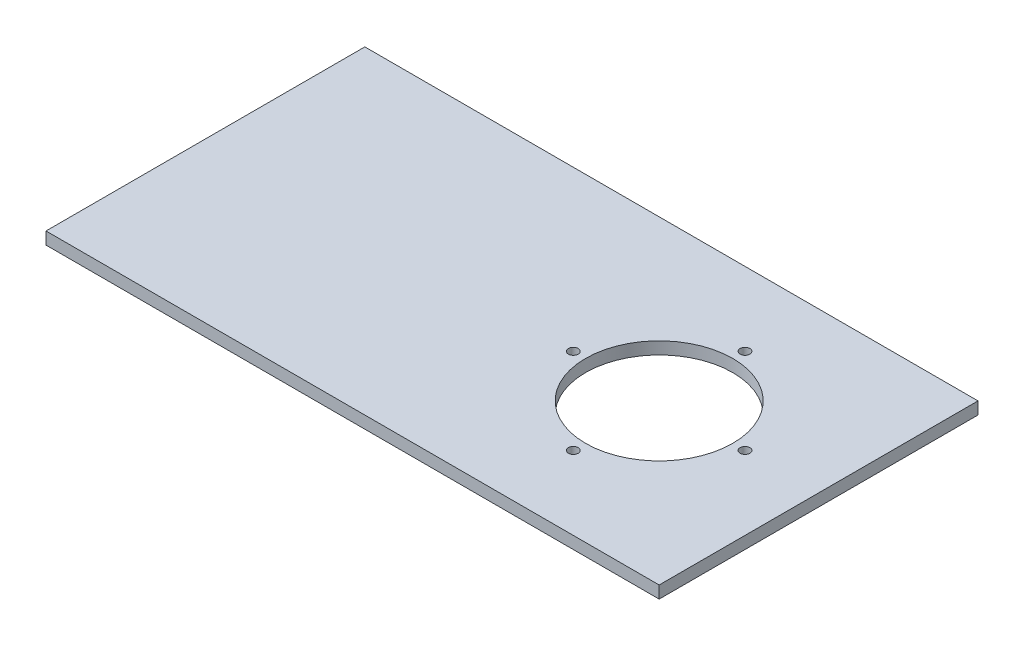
ISO-10303-21;
HEADER;
FILE_DESCRIPTION(('STEP AP214'),'2;1');
FILE_NAME('part.step','',(''),(''),'','','');
FILE_SCHEMA(('AUTOMOTIVE_DESIGN { 1 0 10303 214 1 1 1 1 }'));
ENDSEC;
DATA;
#1=APPLICATION_CONTEXT('core data for automotive mechanical design processes');
#2=APPLICATION_PROTOCOL_DEFINITION('international standard','automotive_design',2000,#1);
#3=PRODUCT_CONTEXT('',#1,'mechanical');
#4=PRODUCT('Part','Part','',(#3));
#5=PRODUCT_RELATED_PRODUCT_CATEGORY('part','',(#4));
#6=PRODUCT_DEFINITION_FORMATION('','',#4);
#7=PRODUCT_DEFINITION_CONTEXT('part definition',#1,'design');
#8=PRODUCT_DEFINITION('design','',#6,#7);
#9=PRODUCT_DEFINITION_SHAPE('','',#8);
#10=(LENGTH_UNIT() NAMED_UNIT(*) SI_UNIT(.MILLI.,.METRE.));
#11=(NAMED_UNIT(*) PLANE_ANGLE_UNIT() SI_UNIT($,.RADIAN.));
#12=(NAMED_UNIT(*) SI_UNIT($,.STERADIAN.) SOLID_ANGLE_UNIT());
#13=UNCERTAINTY_MEASURE_WITH_UNIT(LENGTH_MEASURE(1.E-05),#10,'distance_accuracy_value','');
#14=(GEOMETRIC_REPRESENTATION_CONTEXT(3) GLOBAL_UNCERTAINTY_ASSIGNED_CONTEXT((#13)) GLOBAL_UNIT_ASSIGNED_CONTEXT((#10,
#11,#12)) REPRESENTATION_CONTEXT('',''));
#15=CARTESIAN_POINT('',(0.,0.,0.));
#16=DIRECTION('',(0.,0.,1.));
#17=DIRECTION('',(1.,0.,0.));
#18=AXIS2_PLACEMENT_3D('',#15,#16,#17);
#19=CARTESIAN_POINT('',(0.,6.35,0.));
#20=DIRECTION('',(1.,0.,0.));
#21=DIRECTION('',(0.,0.,-1.));
#22=AXIS2_PLACEMENT_3D('',#19,#20,#21);
#23=PLANE('',#22);
#24=DIRECTION('',(0.,0.,1.));
#25=VECTOR('',#24,1.);
#26=CARTESIAN_POINT('',(0.,0.,0.));
#27=LINE('',#26,#25);
#28=CARTESIAN_POINT('',(0.,0.,-165.1));
#29=VERTEX_POINT('',#28);
#30=CARTESIAN_POINT('',(0.,0.,0.));
#31=VERTEX_POINT('',#30);
#32=EDGE_CURVE('E113',#29,#31,#27,.T.);
#33=ORIENTED_EDGE('',*,*,#32,.T.);
#34=DIRECTION('',(0.,-1.,0.));
#35=VECTOR('',#34,1.);
#36=CARTESIAN_POINT('',(0.,6.35,0.));
#37=LINE('',#36,#35);
#38=CARTESIAN_POINT('',(0.,6.35,0.));
#39=VERTEX_POINT('',#38);
#40=EDGE_CURVE('E11',#39,#31,#37,.T.);
#41=ORIENTED_EDGE('',*,*,#40,.F.);
#42=DIRECTION('',(0.,0.,1.));
#43=VECTOR('',#42,1.);
#44=CARTESIAN_POINT('',(0.,6.35,0.));
#45=LINE('',#44,#43);
#46=CARTESIAN_POINT('',(0.,6.35,-165.1));
#47=VERTEX_POINT('',#46);
#48=EDGE_CURVE('E97',#47,#39,#45,.T.);
#49=ORIENTED_EDGE('',*,*,#48,.F.);
#50=DIRECTION('',(0.,-1.,0.));
#51=VECTOR('',#50,1.);
#52=CARTESIAN_POINT('',(0.,6.35,-165.1));
#53=LINE('',#52,#51);
#54=EDGE_CURVE('E109',#47,#29,#53,.T.);
#55=ORIENTED_EDGE('',*,*,#54,.T.);
#56=EDGE_LOOP('',(#33,#41,#49,#55));
#57=FACE_BOUND('',#56,.T.);
#58=ADVANCED_FACE('F45',(#57),#23,.F.);
#59=CARTESIAN_POINT('',(0.,6.35,0.));
#60=DIRECTION('',(0.,0.,-1.));
#61=DIRECTION('',(-1.,0.,0.));
#62=AXIS2_PLACEMENT_3D('',#59,#60,#61);
#63=PLANE('',#62);
#64=DIRECTION('',(1.,0.,0.));
#65=VECTOR('',#64,1.);
#66=CARTESIAN_POINT('',(0.,0.,0.));
#67=LINE('',#66,#65);
#68=CARTESIAN_POINT('',(317.5,0.,0.));
#69=VERTEX_POINT('',#68);
#70=EDGE_CURVE('E102',#31,#69,#67,.T.);
#71=ORIENTED_EDGE('',*,*,#70,.T.);
#72=DIRECTION('',(0.,-1.,0.));
#73=VECTOR('',#72,1.);
#74=CARTESIAN_POINT('',(317.5,6.35,0.));
#75=LINE('',#74,#73);
#76=CARTESIAN_POINT('',(317.5,6.35,0.));
#77=VERTEX_POINT('',#76);
#78=EDGE_CURVE('E54',#77,#69,#75,.T.);
#79=ORIENTED_EDGE('',*,*,#78,.F.);
#80=DIRECTION('',(1.,0.,0.));
#81=VECTOR('',#80,1.);
#82=CARTESIAN_POINT('',(0.,6.35,0.));
#83=LINE('',#82,#81);
#84=EDGE_CURVE('E92',#39,#77,#83,.T.);
#85=ORIENTED_EDGE('',*,*,#84,.F.);
#86=ORIENTED_EDGE('',*,*,#40,.T.);
#87=EDGE_LOOP('',(#71,#79,#85,#86));
#88=FACE_BOUND('',#87,.T.);
#89=ADVANCED_FACE('F101',(#88),#63,.F.);
#90=CARTESIAN_POINT('',(317.5,6.35,0.));
#91=DIRECTION('',(-1.,0.,0.));
#92=DIRECTION('',(0.,0.,1.));
#93=AXIS2_PLACEMENT_3D('',#90,#91,#92);
#94=PLANE('',#93);
#95=DIRECTION('',(0.,0.,-1.));
#96=VECTOR('',#95,1.);
#97=CARTESIAN_POINT('',(317.5,0.,0.));
#98=LINE('',#97,#96);
#99=CARTESIAN_POINT('',(317.5,0.,-165.1));
#100=VERTEX_POINT('',#99);
#101=EDGE_CURVE('E79',#69,#100,#98,.T.);
#102=ORIENTED_EDGE('',*,*,#101,.T.);
#103=DIRECTION('',(0.,-1.,0.));
#104=VECTOR('',#103,1.);
#105=CARTESIAN_POINT('',(317.5,6.35,-165.1));
#106=LINE('',#105,#104);
#107=CARTESIAN_POINT('',(317.5,6.35,-165.1));
#108=VERTEX_POINT('',#107);
#109=EDGE_CURVE('E104',#108,#100,#106,.T.);
#110=ORIENTED_EDGE('',*,*,#109,.F.);
#111=DIRECTION('',(0.,0.,-1.));
#112=VECTOR('',#111,1.);
#113=CARTESIAN_POINT('',(317.5,6.35,0.));
#114=LINE('',#113,#112);
#115=EDGE_CURVE('E95',#77,#108,#114,.T.);
#116=ORIENTED_EDGE('',*,*,#115,.F.);
#117=ORIENTED_EDGE('',*,*,#78,.T.);
#118=EDGE_LOOP('',(#102,#110,#116,#117));
#119=FACE_BOUND('',#118,.T.);
#120=ADVANCED_FACE('F105',(#119),#94,.F.);
#121=CARTESIAN_POINT('',(0.,6.35,-165.1));
#122=DIRECTION('',(0.,0.,1.));
#123=DIRECTION('',(1.,0.,0.));
#124=AXIS2_PLACEMENT_3D('',#121,#122,#123);
#125=PLANE('',#124);
#126=DIRECTION('',(-1.,0.,0.));
#127=VECTOR('',#126,1.);
#128=CARTESIAN_POINT('',(0.,0.,-165.1));
#129=LINE('',#128,#127);
#130=EDGE_CURVE('E85',#100,#29,#129,.T.);
#131=ORIENTED_EDGE('',*,*,#130,.T.);
#132=ORIENTED_EDGE('',*,*,#54,.F.);
#133=DIRECTION('',(-1.,0.,0.));
#134=VECTOR('',#133,1.);
#135=CARTESIAN_POINT('',(0.,6.35,-165.1));
#136=LINE('',#135,#134);
#137=EDGE_CURVE('E62',#108,#47,#136,.T.);
#138=ORIENTED_EDGE('',*,*,#137,.F.);
#139=ORIENTED_EDGE('',*,*,#109,.T.);
#140=EDGE_LOOP('',(#131,#132,#138,#139));
#141=FACE_BOUND('',#140,.T.);
#142=ADVANCED_FACE('F127',(#141),#125,.F.);
#143=CARTESIAN_POINT('',(0.,6.35,0.));
#144=DIRECTION('',(0.,-1.,0.));
#145=DIRECTION('',(0.,0.,-1.));
#146=AXIS2_PLACEMENT_3D('',#143,#144,#145);
#147=PLANE('',#146);
#148=CARTESIAN_POINT('',(234.95,6.35,-127.));
#149=DIRECTION('',(0.,1.,0.));
#150=DIRECTION('',(0.,0.,1.));
#151=AXIS2_PLACEMENT_3D('',#148,#149,#150);
#152=CIRCLE('',#151,2.54000000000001);
#153=CARTESIAN_POINT('',(234.95,6.35,-124.46));
#154=VERTEX_POINT('',#153);
#155=EDGE_CURVE('E166',#154,#154,#152,.T.);
#156=ORIENTED_EDGE('',*,*,#155,.F.);
#157=EDGE_LOOP('',(#156));
#158=FACE_BOUND('',#157,.T.);
#159=CARTESIAN_POINT('',(279.4,6.35,-82.5499999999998));
#160=DIRECTION('',(0.,1.,0.));
#161=DIRECTION('',(0.,0.,1.));
#162=AXIS2_PLACEMENT_3D('',#159,#160,#161);
#163=CIRCLE('',#162,2.54000000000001);
#164=CARTESIAN_POINT('',(279.4,6.35,-80.0099999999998));
#165=VERTEX_POINT('',#164);
#166=EDGE_CURVE('E162',#165,#165,#163,.T.);
#167=ORIENTED_EDGE('',*,*,#166,.F.);
#168=EDGE_LOOP('',(#167));
#169=FACE_BOUND('',#168,.T.);
#170=CARTESIAN_POINT('',(234.95,6.35,-38.1));
#171=DIRECTION('',(0.,1.,0.));
#172=DIRECTION('',(0.,0.,1.));
#173=AXIS2_PLACEMENT_3D('',#170,#171,#172);
#174=CIRCLE('',#173,2.54);
#175=CARTESIAN_POINT('',(234.95,6.35,-35.56));
#176=VERTEX_POINT('',#175);
#177=EDGE_CURVE('E154',#176,#176,#174,.T.);
#178=ORIENTED_EDGE('',*,*,#177,.F.);
#179=EDGE_LOOP('',(#178));
#180=FACE_BOUND('',#179,.T.);
#181=CARTESIAN_POINT('',(190.5,6.35,-82.5500000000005));
#182=DIRECTION('',(0.,1.,0.));
#183=DIRECTION('',(0.,0.,1.));
#184=AXIS2_PLACEMENT_3D('',#181,#182,#183);
#185=CIRCLE('',#184,2.54);
#186=CARTESIAN_POINT('',(190.5,6.35,-80.0100000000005));
#187=VERTEX_POINT('',#186);
#188=EDGE_CURVE('E146',#187,#187,#185,.T.);
#189=ORIENTED_EDGE('',*,*,#188,.F.);
#190=EDGE_LOOP('',(#189));
#191=FACE_BOUND('',#190,.T.);
#192=CARTESIAN_POINT('',(234.95,6.35,-82.55));
#193=DIRECTION('',(0.,1.,0.));
#194=DIRECTION('',(0.,0.,1.));
#195=AXIS2_PLACEMENT_3D('',#192,#193,#194);
#196=CIRCLE('',#195,38.1);
#197=CARTESIAN_POINT('',(234.95,6.35,-44.45));
#198=VERTEX_POINT('',#197);
#199=EDGE_CURVE('E134',#198,#198,#196,.T.);
#200=ORIENTED_EDGE('',*,*,#199,.F.);
#201=EDGE_LOOP('',(#200));
#202=FACE_BOUND('',#201,.T.);
#203=ORIENTED_EDGE('',*,*,#48,.T.);
#204=ORIENTED_EDGE('',*,*,#84,.T.);
#205=ORIENTED_EDGE('',*,*,#115,.T.);
#206=ORIENTED_EDGE('',*,*,#137,.T.);
#207=EDGE_LOOP('',(#203,#204,#205,#206));
#208=FACE_BOUND('',#207,.T.);
#209=ADVANCED_FACE('F93',(#158,#169,#180,#191,#202,#208),#147,.F.);
#210=CARTESIAN_POINT('',(0.,0.,0.));
#211=DIRECTION('',(0.,-1.,0.));
#212=DIRECTION('',(0.,0.,-1.));
#213=AXIS2_PLACEMENT_3D('',#210,#211,#212);
#214=PLANE('',#213);
#215=CARTESIAN_POINT('',(234.95,0.,-127.));
#216=DIRECTION('',(0.,1.,0.));
#217=DIRECTION('',(0.,0.,1.));
#218=AXIS2_PLACEMENT_3D('',#215,#216,#217);
#219=CIRCLE('',#218,2.54000000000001);
#220=CARTESIAN_POINT('',(234.95,0.,-124.46));
#221=VERTEX_POINT('',#220);
#222=EDGE_CURVE('E138',#221,#221,#219,.T.);
#223=ORIENTED_EDGE('',*,*,#222,.T.);
#224=EDGE_LOOP('',(#223));
#225=FACE_BOUND('',#224,.T.);
#226=CARTESIAN_POINT('',(279.4,0.,-82.5499999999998));
#227=DIRECTION('',(0.,1.,0.));
#228=DIRECTION('',(0.,0.,1.));
#229=AXIS2_PLACEMENT_3D('',#226,#227,#228);
#230=CIRCLE('',#229,2.54000000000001);
#231=CARTESIAN_POINT('',(279.4,0.,-80.0099999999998));
#232=VERTEX_POINT('',#231);
#233=EDGE_CURVE('E158',#232,#232,#230,.T.);
#234=ORIENTED_EDGE('',*,*,#233,.T.);
#235=EDGE_LOOP('',(#234));
#236=FACE_BOUND('',#235,.T.);
#237=CARTESIAN_POINT('',(234.95,0.,-38.1));
#238=DIRECTION('',(0.,1.,0.));
#239=DIRECTION('',(0.,0.,1.));
#240=AXIS2_PLACEMENT_3D('',#237,#238,#239);
#241=CIRCLE('',#240,2.54);
#242=CARTESIAN_POINT('',(234.95,0.,-35.56));
#243=VERTEX_POINT('',#242);
#244=EDGE_CURVE('E150',#243,#243,#241,.T.);
#245=ORIENTED_EDGE('',*,*,#244,.T.);
#246=EDGE_LOOP('',(#245));
#247=FACE_BOUND('',#246,.T.);
#248=CARTESIAN_POINT('',(190.5,0.,-82.5500000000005));
#249=DIRECTION('',(0.,1.,0.));
#250=DIRECTION('',(0.,0.,1.));
#251=AXIS2_PLACEMENT_3D('',#248,#249,#250);
#252=CIRCLE('',#251,2.54);
#253=CARTESIAN_POINT('',(190.5,0.,-80.0100000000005));
#254=VERTEX_POINT('',#253);
#255=EDGE_CURVE('E142',#254,#254,#252,.T.);
#256=ORIENTED_EDGE('',*,*,#255,.T.);
#257=EDGE_LOOP('',(#256));
#258=FACE_BOUND('',#257,.T.);
#259=CARTESIAN_POINT('',(234.95,0.,-82.55));
#260=DIRECTION('',(0.,1.,0.));
#261=DIRECTION('',(0.,0.,1.));
#262=AXIS2_PLACEMENT_3D('',#259,#260,#261);
#263=CIRCLE('',#262,38.1);
#264=CARTESIAN_POINT('',(234.95,0.,-44.45));
#265=VERTEX_POINT('',#264);
#266=EDGE_CURVE('E117',#265,#265,#263,.T.);
#267=ORIENTED_EDGE('',*,*,#266,.T.);
#268=EDGE_LOOP('',(#267));
#269=FACE_BOUND('',#268,.T.);
#270=ORIENTED_EDGE('',*,*,#32,.F.);
#271=ORIENTED_EDGE('',*,*,#130,.F.);
#272=ORIENTED_EDGE('',*,*,#101,.F.);
#273=ORIENTED_EDGE('',*,*,#70,.F.);
#274=EDGE_LOOP('',(#270,#271,#272,#273));
#275=FACE_BOUND('',#274,.T.);
#276=ADVANCED_FACE('F130',(#225,#236,#247,#258,#269,#275),#214,.T.);
#277=CARTESIAN_POINT('',(234.95,0.,-82.55));
#278=DIRECTION('',(0.,1.,0.));
#279=DIRECTION('',(0.,0.,1.));
#280=AXIS2_PLACEMENT_3D('',#277,#278,#279);
#281=CYLINDRICAL_SURFACE('',#280,38.1);
#282=ORIENTED_EDGE('',*,*,#266,.F.);
#283=EDGE_LOOP('',(#282));
#284=FACE_BOUND('',#283,.T.);
#285=ORIENTED_EDGE('',*,*,#199,.T.);
#286=EDGE_LOOP('',(#285));
#287=FACE_BOUND('',#286,.T.);
#288=ADVANCED_FACE('F194',(#284,#287),#281,.F.);
#289=CARTESIAN_POINT('',(190.5,0.,-82.5500000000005));
#290=DIRECTION('',(0.,1.,0.));
#291=DIRECTION('',(0.,0.,1.));
#292=AXIS2_PLACEMENT_3D('',#289,#290,#291);
#293=CYLINDRICAL_SURFACE('',#292,2.54);
#294=ORIENTED_EDGE('',*,*,#255,.F.);
#295=EDGE_LOOP('',(#294));
#296=FACE_BOUND('',#295,.T.);
#297=ORIENTED_EDGE('',*,*,#188,.T.);
#298=EDGE_LOOP('',(#297));
#299=FACE_BOUND('',#298,.T.);
#300=ADVANCED_FACE('F196',(#296,#299),#293,.F.);
#301=CARTESIAN_POINT('',(234.95,0.,-38.1));
#302=DIRECTION('',(0.,1.,0.));
#303=DIRECTION('',(0.,0.,1.));
#304=AXIS2_PLACEMENT_3D('',#301,#302,#303);
#305=CYLINDRICAL_SURFACE('',#304,2.54);
#306=ORIENTED_EDGE('',*,*,#244,.F.);
#307=EDGE_LOOP('',(#306));
#308=FACE_BOUND('',#307,.T.);
#309=ORIENTED_EDGE('',*,*,#177,.T.);
#310=EDGE_LOOP('',(#309));
#311=FACE_BOUND('',#310,.T.);
#312=ADVANCED_FACE('F203',(#308,#311),#305,.F.);
#313=CARTESIAN_POINT('',(279.4,0.,-82.5499999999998));
#314=DIRECTION('',(0.,1.,0.));
#315=DIRECTION('',(0.,0.,1.));
#316=AXIS2_PLACEMENT_3D('',#313,#314,#315);
#317=CYLINDRICAL_SURFACE('',#316,2.54000000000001);
#318=ORIENTED_EDGE('',*,*,#233,.F.);
#319=EDGE_LOOP('',(#318));
#320=FACE_BOUND('',#319,.T.);
#321=ORIENTED_EDGE('',*,*,#166,.T.);
#322=EDGE_LOOP('',(#321));
#323=FACE_BOUND('',#322,.T.);
#324=ADVANCED_FACE('F179',(#320,#323),#317,.F.);
#325=CARTESIAN_POINT('',(234.95,0.,-127.));
#326=DIRECTION('',(0.,1.,0.));
#327=DIRECTION('',(0.,0.,1.));
#328=AXIS2_PLACEMENT_3D('',#325,#326,#327);
#329=CYLINDRICAL_SURFACE('',#328,2.54000000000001);
#330=ORIENTED_EDGE('',*,*,#222,.F.);
#331=EDGE_LOOP('',(#330));
#332=FACE_BOUND('',#331,.T.);
#333=ORIENTED_EDGE('',*,*,#155,.T.);
#334=EDGE_LOOP('',(#333));
#335=FACE_BOUND('',#334,.T.);
#336=ADVANCED_FACE('F176',(#332,#335),#329,.F.);
#337=CLOSED_SHELL('',(#58,#89,#120,#142,#209,#276,#288,#300,#312,#324,#336));
#338=MANIFOLD_SOLID_BREP('B2',#337);
#339=ADVANCED_BREP_SHAPE_REPRESENTATION('',(#18,#338),#14);
#340=SHAPE_DEFINITION_REPRESENTATION(#9,#339);
ENDSEC;
END-ISO-10303-21;
